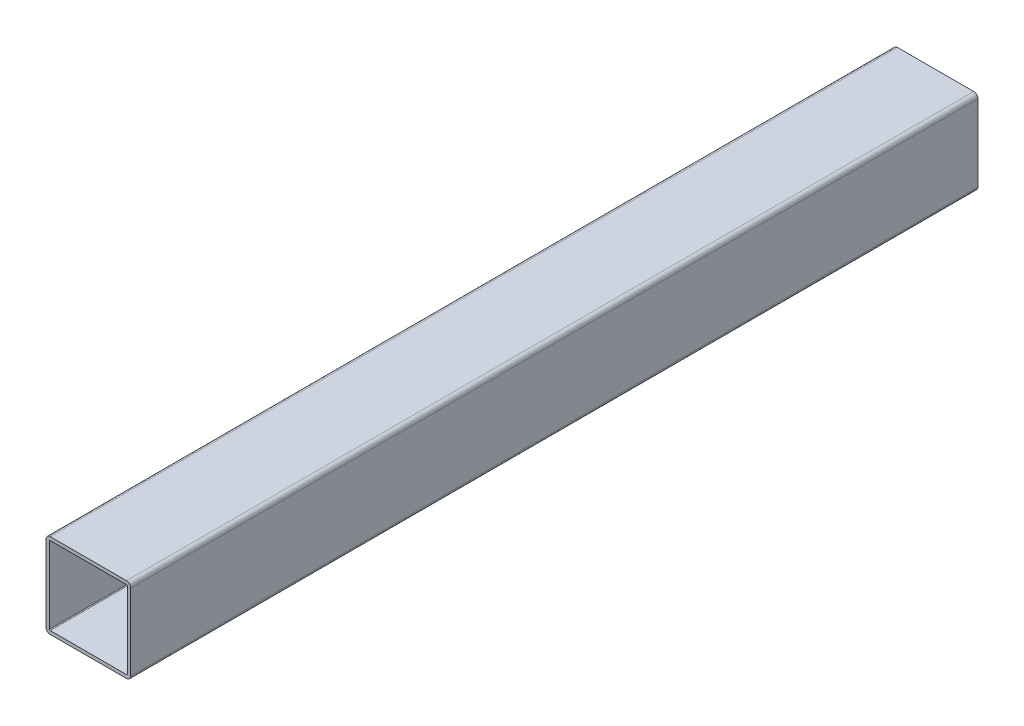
from build123d import *

# Parameters (mm, degrees)
BASE_EXTRUSION_DEPTH = 1000


with BuildPart() as part:
    # Esquisse1 → Base-Extrusion (new body)
    with BuildSketch(Plane.XY):
        with BuildLine():
            Line((5, 0), (95, 0))
            ThreePointArc((95, 0), (98.535533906, -1.464466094), (100, -5))
            Line((100, -5), (100, -95))
            ThreePointArc((100, -95), (98.535533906, -98.535533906), (95, -100))
            Line((95, -100), (5, -100))
            ThreePointArc((5, -100), (1.464466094, -98.535533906), (0, -95))
            Line((0, -95), (0, -5))
            ThreePointArc((0, -5), (1.464466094, -1.464466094), (5, 0))
        make_face()
        with BuildLine():
            Line((5, -4), (95, -4))
            ThreePointArc((95, -4), (95.707106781, -4.292893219), (96, -5))
            Line((96, -5), (96, -95))
            ThreePointArc((96, -95), (95.707106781, -95.707106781), (95, -96))
            Line((95, -96), (5, -96))
            ThreePointArc((5, -96), (4.292893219, -95.707106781), (4, -95))
            Line((4, -95), (4, -5))
            ThreePointArc((4, -5), (4.292893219, -4.292893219), (5, -4))
        make_face(mode=Mode.SUBTRACT)
    extrude(amount=BASE_EXTRUSION_DEPTH)


solid = part.part
